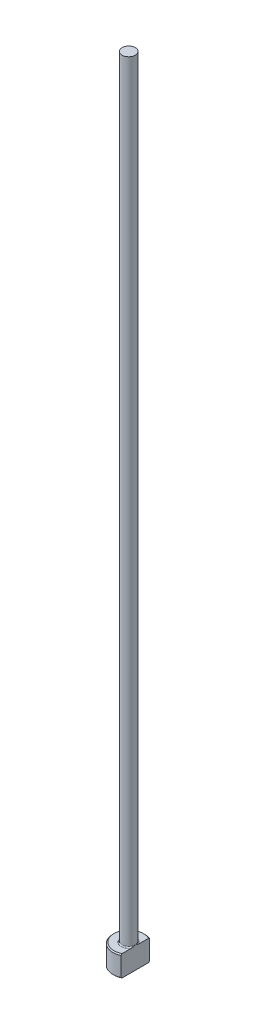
from build123d import *
from build123d.topology import SkipClean

# Parameters (mm, degrees)
CHAMFER1_SIZE    = 0.2
FILLET1_R        = 0.2
KEYED_HEAD_DEPTH = 151.059988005


with BuildPart() as part:
    # Sketch1 → Revolve1 (revolve)
    with BuildSketch(Plane.XY, mode=Mode.PRIVATE) as revolve1_sk:
        Polygon((0, 0), (-3, 0), (-3, 4), (-1.25, 4), (-1.25, 150), (0, 150), align=None)
    revolve(revolve1_sk.sketch.rotate(Axis((0, 259.958771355, 0), (0, -1, 0)), 270), axis=Axis((0, 259.958771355, 0), (0, -1, 0)))

    # Chamfer1
    chamfer1_edges = [part.edges().sort_by_distance(p)[0] for p in [
        (0, 4, -3),
        (0, 0, -3),
    ]]
    chamfer(chamfer1_edges, length=CHAMFER1_SIZE)

    # Fillet1
    fillet1_edges = [part.edges().sort_by_distance(p)[0] for p in [
        (0, 4, -1.25),
    ]]
    fillet(fillet1_edges, radius=FILLET1_R)

    # Sketch2 → KEYED HEAD (cut, through all)
    with SkipClean():  # the faces are left unmerged after this step: merging them gives an invalid solid
        with BuildSketch(Plane(origin=(0, 0, 0), x_dir=(1, 0, 0), z_dir=(0, 1, 0))):
            with BuildLine():
                Line((1.25, -2.727178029), (1.25, 2.727178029))
                ThreePointArc((1.25, 2.727178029), (3, 0), (1.25, -2.727178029))
            make_face()
        extrude(amount=KEYED_HEAD_DEPTH, mode=Mode.SUBTRACT)


solid = part.part
